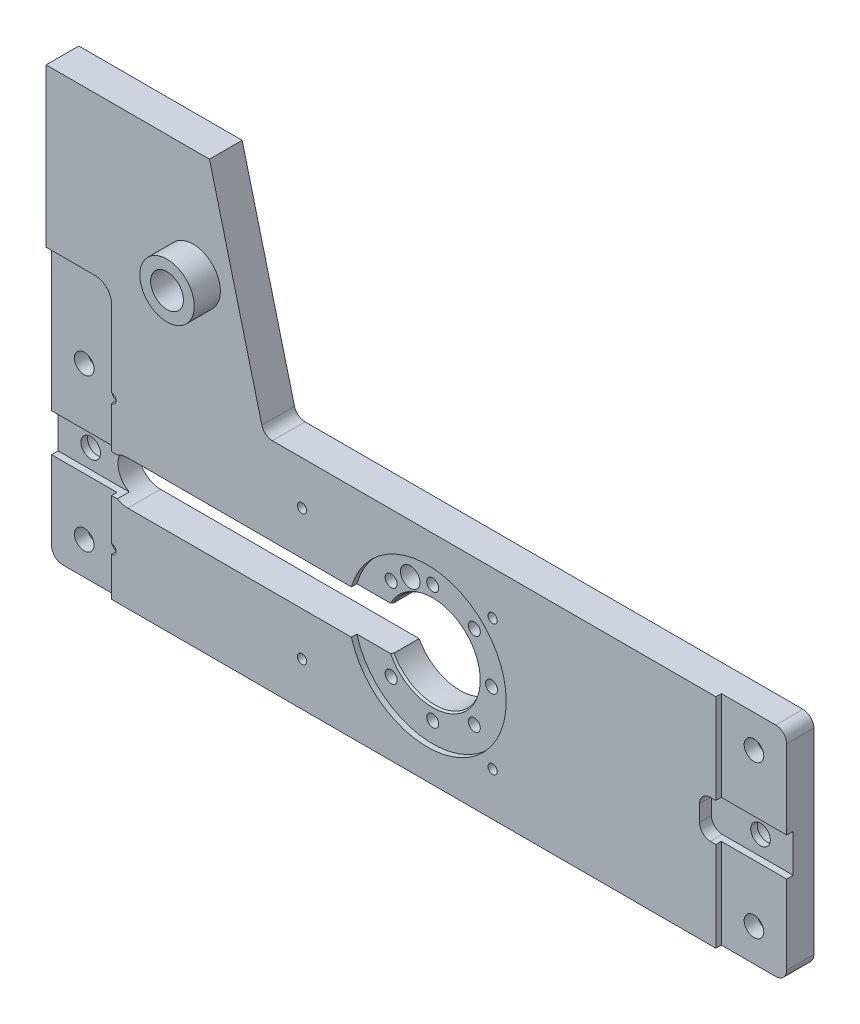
from build123d import *

# Parameters (mm, degrees)
EXTRUSION1_DEPTH                = 30
ESQUISSE2_R                     = 25
EXTRUSION2_DEPTH                = 29
ESQUISSE3_R                     = 72.5
ESQUISSE3_W                     = 60
ESQUISSE3_H                     = 200
ENL_V_MAT_EXTRU_1_DEPTH         = 5
ENL_V_MAT_EXTRU_2_DEPTH         = 16
ENL_V_MAT_EXTRU_2_DEPTH_BACK    = 6
ESQUISSE4_W                     = 104.363798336
ESQUISSE4_H                     = 35
ESQUISSE5_W                     = 67.14344942
ESQUISSE5_H                     = 142.475124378
ENL_V_MAT_EXTRU_3_DEPTH         = 246
ESQUISSE6_R                     = 15.05
ESQUISSE6_R_2                   = 42.5
ENL_V_MAT_EXTRU_4_DEPTH         = 784.94259994
R_P_TITION_LIN_AIRE1_COUNT      = 2
R_P_TITION_LIN_AIRE1_PITCH      = 615
R_P_TITION_LIN_AIRE1_COUNT_DIR2 = 3
R_P_TITION_LIN_AIRE1_PITCH_DIR2 = 70
TROU_TARAUD_M10X1_51_D          = 8.5
R_P_TITION_LIN_AIRE2_COUNT      = 3
R_P_TITION_LIN_AIRE2_PITCH      = 175
R_P_TITION_LIN_AIRE2_COUNT_DIR2 = 2
R_P_TITION_LIN_AIRE2_PITCH_DIR2 = 120
TROU_TARAUD_M10X1_52_D          = 8.5
TROU_TARAUD_M10X1_52_DEPTH      = 25
TROU_TARAUD_M10X1_52_TIP        = 2.553657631
ESQUISSE12_R                    = 9
ESQUISSE12_R_2                  = 5.5
ENL_V_MAT_EXTRU_5_DEPTH         = 783.618042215
ESQUISSE15_R                    = 9
ENL_V_MAT_EXTRU_6_DEPTH         = 13
CHANFREIN1_SIZE                 = 2
CHANFREIN1_SIZE2                = 1.154700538


with BuildPart() as part:
    # Esquisse1 → Extrusion1 (new body)
    with BuildSketch(Plane.XY):
        with BuildLine():
            Line((10, 0), (665, 0))
            ThreePointArc((665, 0), (672.071067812, 2.928932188), (675, 10))
            Line((675, 10), (675, 190))
            ThreePointArc((675, 190), (672.071067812, 197.071067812), (665, 200))
            Line((665, 200), (207.759395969, 200))
            ThreePointArc((207.759395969, 200), (201.629042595, 202.099445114), (198.072757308, 207.516246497))
            Line((198.072757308, 207.516246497), (150, 395))
            Line((150, 395), (0, 395))
            Line((0, 395), (0, 10))
            ThreePointArc((0, 10), (2.928932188, 2.928932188), (10, 0))
        make_face()
        with BuildLine():
            Line((75, 80), (315.937557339, 80))
            ThreePointArc((315.937557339, 80), (389.5, 100), (315.937557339, 120))
            Line((315.937557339, 120), (75, 120))
            ThreePointArc((75, 120), (55, 100), (75, 80))
        make_face(mode=Mode.SUBTRACT)
    extrude(amount=EXTRUSION1_DEPTH)

    # Esquisse2 → Extrusion2 (add)
    with BuildSketch(Plane.XY.offset(30)):
        with Locations(Location((135, 295, 0), (0, 0, 180))):
            Circle(ESQUISSE2_R)
    extrude(amount=EXTRUSION2_DEPTH)

    # Esquisse3 → Enl_v. mat.-Extru.1 (cut)
    with BuildSketch(Plane.XY.offset(30)):
        with Locations((350, 100)):
            Circle(ESQUISSE3_R)
        with BuildLine():
            Line((0, 0), (60, 0))
            Line((60, 0), (60, 235))
            ThreePointArc((60, 235), (55.606601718, 245.606601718), (45, 250))
            Line((45, 250), (0, 250))
            Line((0, 250), (0, 0))
        make_face()
        with Locations((645, 100)):
            Rectangle(ESQUISSE3_W, ESQUISSE3_H)
    extrude(amount=-ENL_V_MAT_EXTRU_1_DEPTH, mode=Mode.SUBTRACT)

    # Esquisse4 → Enl_v. mat.-Extru.2 (cut, two sides: drawn at the far end of the back side and taken through both)
    with BuildSketch(Plane.XY.offset(25).offset(-ENL_V_MAT_EXTRU_2_DEPTH_BACK)):
        with Locations((36.020849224, 100)):
            Rectangle(ESQUISSE4_W, ESQUISSE4_H)
        with BuildLine():
            Line((692.512461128, 82.5), (610, 82.5))
            ThreePointArc((610, 82.5), (602.928932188, 85.428932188), (600, 92.5))
            Line((600, 92.5), (600, 107.5))
            ThreePointArc((600, 107.5), (602.928932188, 114.571067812), (610, 117.5))
            Line((610, 117.5), (692.512461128, 117.5))
            Line((692.512461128, 117.5), (692.512461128, 82.5))
        make_face()
    extrude(amount=ENL_V_MAT_EXTRU_2_DEPTH + ENL_V_MAT_EXTRU_2_DEPTH_BACK, mode=Mode.SUBTRACT)

    # Esquisse5 → Enl_v. mat.-Extru.3 (cut)
    with BuildSketch(Plane.ZY):
        with Locations((87.57172471, 300.671641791)):
            Rectangle(ESQUISSE5_W, ESQUISSE5_H)
    extrude(amount=-ENL_V_MAT_EXTRU_3_DEPTH, mode=Mode.SUBTRACT)

    # Esquisse6 → Enl_v. mat.-Extru.4 (cut, through all)
    with BuildSketch(Plane.XY.offset(54)):
        with Locations((135, 295)):
            Circle(ESQUISSE6_R)
        with Locations((350, 100)):
            Circle(ESQUISSE6_R_2)
    extrude(amount=-ENL_V_MAT_EXTRU_4_DEPTH, mode=Mode.SUBTRACT)

    # Esquisse7 → Per_age1 (revolve, cut)
    with BuildSketch(Plane(origin=(30, 170, 0), x_dir=(0, 1, 0), z_dir=(1, 0, 0))):
        Polygon((0, 0), (0, 59.407745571), (9, 54), (9, 13), (14, 13), (14, 0), align=None)
    per_age1 = revolve(axis=Axis((30, 170, -11.310875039), (0, 0, 1)), mode=Mode.SUBTRACT)

    # R_p_tition lin_aire1: Per_age1 2 × 3
    with Locations(*[(i * R_P_TITION_LIN_AIRE1_PITCH, -j * R_P_TITION_LIN_AIRE1_PITCH_DIR2, 0) for i in range(R_P_TITION_LIN_AIRE1_COUNT) for j in range(R_P_TITION_LIN_AIRE1_COUNT_DIR2) if (i, j) != (0, 0)]):
        add(per_age1, mode=Mode.SUBTRACT)

    # Trou taraud_ M10x1.51 (through all)
    with Locations(Plane.XY.offset(30)):
        with Locations((410, 160)):
            trou_taraud_m10x1_51 = Hole(TROU_TARAUD_M10X1_51_D / 2)

    # R_p_tition lin_aire2: Trou taraud_ M10x1.51 3 × 2
    with Locations(*[(-i * R_P_TITION_LIN_AIRE2_PITCH, -j * R_P_TITION_LIN_AIRE2_PITCH_DIR2, 0) for i in range(R_P_TITION_LIN_AIRE2_COUNT) for j in range(R_P_TITION_LIN_AIRE2_COUNT_DIR2) if (i, j) != (0, 0)]):
        add(trou_taraud_m10x1_51, mode=Mode.SUBTRACT)

    # Trou taraud_ M10x1.52
    with Locations(Plane(origin=(110, 295, 0), x_dir=(-1, 0, 0), z_dir=(0, 0, -1))):
        with Locations((0, 0)):
            Hole(TROU_TARAUD_M10X1_52_D / 2, depth=TROU_TARAUD_M10X1_52_DEPTH)
            with Locations((0, 0, -(TROU_TARAUD_M10X1_52_DEPTH + TROU_TARAUD_M10X1_52_TIP / 2))):  # 118° drill point
                Cone(0, TROU_TARAUD_M10X1_52_D / 2, TROU_TARAUD_M10X1_52_TIP, mode=Mode.SUBTRACT)

    # Esquisse12 → Enl_v. mat.-Extru.5 (cut, through all)
    with BuildSketch(Plane.XY.offset(25)):
        with Locations((329.335094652, 149.889494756)):
            Circle(ESQUISSE12_R)
        with Locations((350, 154)):
            Circle(ESQUISSE12_R_2)
        with Locations((388.183766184, 138.183766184)):
            Circle(ESQUISSE12_R_2)
        with Locations((404, 100)):
            Circle(ESQUISSE12_R_2)
        with Locations((388.183766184, 61.816233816)):
            Circle(ESQUISSE12_R_2)
        with Locations((350, 46)):
            Circle(ESQUISSE12_R_2)
        with Locations((311.816233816, 61.816233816)):
            Circle(ESQUISSE12_R_2)
        with Locations((311.816233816, 138.183766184)):
            Circle(ESQUISSE12_R_2)
    extrude(amount=-ENL_V_MAT_EXTRU_5_DEPTH, mode=Mode.SUBTRACT)

    # Esquisse15 → Enl_v. mat.-Extru.6 (cut)
    with BuildSketch(Plane(origin=(0, 0, 0), x_dir=(-1, 0, 0), z_dir=(0, 0, -1))):
        with Locations((-404, 100)):
            Circle(ESQUISSE15_R)
        with Locations((-388.183766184, 138.183766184)):
            Circle(ESQUISSE15_R)
        with Locations((-350, 154)):
            Circle(ESQUISSE15_R)
        with Locations((-311.816233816, 138.183766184)):
            Circle(ESQUISSE15_R)
        with Locations((-311.816233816, 61.816233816)):
            Circle(ESQUISSE15_R)
        with Locations((-350, 46)):
            Circle(ESQUISSE15_R)
        with Locations((-388.183766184, 61.816233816)):
            Circle(ESQUISSE15_R)
    extrude(amount=-ENL_V_MAT_EXTRU_6_DEPTH, mode=Mode.SUBTRACT)

    # Chanfrein1
    chanfrein1_edges = [part.edges().sort_by_distance(p)[0] for p in [
        (392.5, 100, 25),
    ]]
    chanfrein1_side = [part.faces().sort_by_distance(p)[0] for p in [
        (392.5, 100, 12.5),
    ]]
    chamfer(chanfrein1_edges, length=CHANFREIN1_SIZE, length2=CHANFREIN1_SIZE2, reference=chanfrein1_side[0])


solid = part.part
